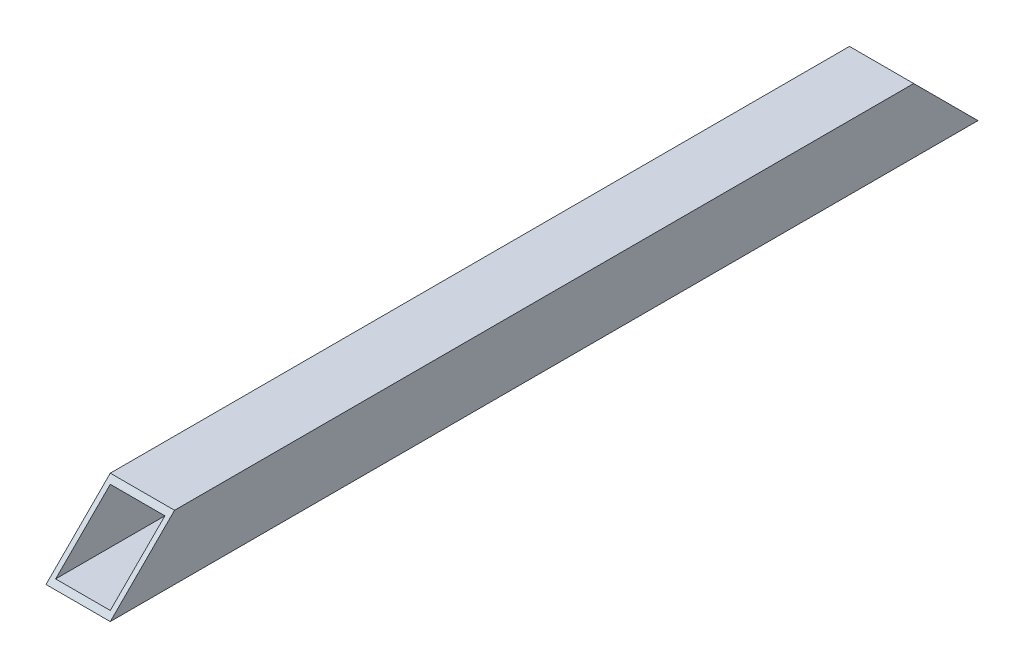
ISO-10303-21;
HEADER;
FILE_DESCRIPTION(('STEP AP214'),'2;1');
FILE_NAME('part.step','',(''),(''),'','','');
FILE_SCHEMA(('AUTOMOTIVE_DESIGN { 1 0 10303 214 1 1 1 1 }'));
ENDSEC;
DATA;
#1=APPLICATION_CONTEXT('core data for automotive mechanical design processes');
#2=APPLICATION_PROTOCOL_DEFINITION('international standard','automotive_design',2000,#1);
#3=PRODUCT_CONTEXT('',#1,'mechanical');
#4=PRODUCT('Part','Part','',(#3));
#5=PRODUCT_RELATED_PRODUCT_CATEGORY('part','',(#4));
#6=PRODUCT_DEFINITION_FORMATION('','',#4);
#7=PRODUCT_DEFINITION_CONTEXT('part definition',#1,'design');
#8=PRODUCT_DEFINITION('design','',#6,#7);
#9=PRODUCT_DEFINITION_SHAPE('','',#8);
#10=(LENGTH_UNIT() NAMED_UNIT(*) SI_UNIT(.MILLI.,.METRE.));
#11=(NAMED_UNIT(*) PLANE_ANGLE_UNIT() SI_UNIT($,.RADIAN.));
#12=(NAMED_UNIT(*) SI_UNIT($,.STERADIAN.) SOLID_ANGLE_UNIT());
#13=UNCERTAINTY_MEASURE_WITH_UNIT(LENGTH_MEASURE(1.E-05),#10,'distance_accuracy_value','');
#14=(GEOMETRIC_REPRESENTATION_CONTEXT(3) GLOBAL_UNCERTAINTY_ASSIGNED_CONTEXT((#13)) GLOBAL_UNIT_ASSIGNED_CONTEXT((#10,
#11,#12)) REPRESENTATION_CONTEXT('',''));
#15=CARTESIAN_POINT('',(0.,0.,0.));
#16=DIRECTION('',(0.,0.,1.));
#17=DIRECTION('',(1.,0.,0.));
#18=AXIS2_PLACEMENT_3D('',#15,#16,#17);
#19=CARTESIAN_POINT('',(0.,0.,540.));
#20=DIRECTION('',(1.,0.,0.));
#21=DIRECTION('',(0.,1.,0.));
#22=AXIS2_PLACEMENT_3D('',#19,#20,#21);
#23=PLANE('',#22);
#24=DIRECTION('',(0.,0.,-1.));
#25=VECTOR('',#24,1.);
#26=CARTESIAN_POINT('',(0.,40.,540.));
#27=LINE('',#26,#25);
#28=CARTESIAN_POINT('',(0.,40.,500.));
#29=VERTEX_POINT('',#28);
#30=CARTESIAN_POINT('',(0.,40.,40.0000000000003));
#31=VERTEX_POINT('',#30);
#32=EDGE_CURVE('E131',#29,#31,#27,.T.);
#33=ORIENTED_EDGE('',*,*,#32,.T.);
#34=DIRECTION('',(0.,-0.707106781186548,-0.707106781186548));
#35=VECTOR('',#34,1.);
#36=CARTESIAN_POINT('',(0.,40.,40.0000000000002));
#37=LINE('',#36,#35);
#38=CARTESIAN_POINT('',(0.,0.,0.));
#39=VERTEX_POINT('',#38);
#40=EDGE_CURVE('E42',#31,#39,#37,.T.);
#41=ORIENTED_EDGE('',*,*,#40,.T.);
#42=DIRECTION('',(0.,0.,-1.));
#43=VECTOR('',#42,1.);
#44=CARTESIAN_POINT('',(0.,0.,540.));
#45=LINE('',#44,#43);
#46=CARTESIAN_POINT('',(0.,0.,540.));
#47=VERTEX_POINT('',#46);
#48=EDGE_CURVE('E124',#47,#39,#45,.T.);
#49=ORIENTED_EDGE('',*,*,#48,.F.);
#50=DIRECTION('',(0.,-0.707106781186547,0.707106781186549));
#51=VECTOR('',#50,1.);
#52=CARTESIAN_POINT('',(0.,0.,540.));
#53=LINE('',#52,#51);
#54=EDGE_CURVE('E121',#47,#29,#53,.F.);
#55=ORIENTED_EDGE('',*,*,#54,.T.);
#56=EDGE_LOOP('',(#33,#41,#49,#55));
#57=FACE_BOUND('',#56,.T.);
#58=ADVANCED_FACE('F32',(#57),#23,.F.);
#59=CARTESIAN_POINT('',(0.,0.,540.));
#60=DIRECTION('',(0.,1.,0.));
#61=DIRECTION('',(0.,0.,1.));
#62=AXIS2_PLACEMENT_3D('',#59,#60,#61);
#63=PLANE('',#62);
#64=DIRECTION('',(1.,0.,0.));
#65=VECTOR('',#64,1.);
#66=CARTESIAN_POINT('',(0.,0.,0.));
#67=LINE('',#66,#65);
#68=CARTESIAN_POINT('',(40.,0.,0.));
#69=VERTEX_POINT('',#68);
#70=EDGE_CURVE('E88',#39,#69,#67,.T.);
#71=ORIENTED_EDGE('',*,*,#70,.T.);
#72=DIRECTION('',(0.,0.,-1.));
#73=VECTOR('',#72,1.);
#74=CARTESIAN_POINT('',(40.,0.,540.));
#75=LINE('',#74,#73);
#76=CARTESIAN_POINT('',(40.,0.,540.));
#77=VERTEX_POINT('',#76);
#78=EDGE_CURVE('E127',#77,#69,#75,.T.);
#79=ORIENTED_EDGE('',*,*,#78,.F.);
#80=DIRECTION('',(1.,0.,0.));
#81=VECTOR('',#80,1.);
#82=CARTESIAN_POINT('',(0.,0.,540.));
#83=LINE('',#82,#81);
#84=EDGE_CURVE('E134',#47,#77,#83,.T.);
#85=ORIENTED_EDGE('',*,*,#84,.F.);
#86=ORIENTED_EDGE('',*,*,#48,.T.);
#87=EDGE_LOOP('',(#71,#79,#85,#86));
#88=FACE_BOUND('',#87,.T.);
#89=ADVANCED_FACE('F173',(#88),#63,.F.);
#90=CARTESIAN_POINT('',(40.,0.,540.));
#91=DIRECTION('',(-1.,0.,0.));
#92=DIRECTION('',(0.,-1.,0.));
#93=AXIS2_PLACEMENT_3D('',#90,#91,#92);
#94=PLANE('',#93);
#95=ORIENTED_EDGE('',*,*,#78,.T.);
#96=DIRECTION('',(0.,0.707106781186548,0.707106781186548));
#97=VECTOR('',#96,1.);
#98=CARTESIAN_POINT('',(40.,40.,40.0000000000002));
#99=LINE('',#98,#97);
#100=CARTESIAN_POINT('',(40.,40.,40.0000000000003));
#101=VERTEX_POINT('',#100);
#102=EDGE_CURVE('E11',#69,#101,#99,.T.);
#103=ORIENTED_EDGE('',*,*,#102,.T.);
#104=DIRECTION('',(0.,0.,-1.));
#105=VECTOR('',#104,1.);
#106=CARTESIAN_POINT('',(40.,40.,540.));
#107=LINE('',#106,#105);
#108=CARTESIAN_POINT('',(40.,40.,500.));
#109=VERTEX_POINT('',#108);
#110=EDGE_CURVE('E129',#109,#101,#107,.T.);
#111=ORIENTED_EDGE('',*,*,#110,.F.);
#112=DIRECTION('',(0.,0.707106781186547,-0.707106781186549));
#113=VECTOR('',#112,1.);
#114=CARTESIAN_POINT('',(40.,0.,540.));
#115=LINE('',#114,#113);
#116=EDGE_CURVE('E107',#109,#77,#115,.F.);
#117=ORIENTED_EDGE('',*,*,#116,.T.);
#118=EDGE_LOOP('',(#95,#103,#111,#117));
#119=FACE_BOUND('',#118,.T.);
#120=ADVANCED_FACE('F179',(#119),#94,.F.);
#121=CARTESIAN_POINT('',(0.,40.,540.));
#122=DIRECTION('',(0.,-1.,0.));
#123=DIRECTION('',(0.,0.,-1.));
#124=AXIS2_PLACEMENT_3D('',#121,#122,#123);
#125=PLANE('',#124);
#126=ORIENTED_EDGE('',*,*,#110,.T.);
#127=DIRECTION('',(-1.,0.,0.));
#128=VECTOR('',#127,1.);
#129=CARTESIAN_POINT('',(0.,40.,40.0000000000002));
#130=LINE('',#129,#128);
#131=EDGE_CURVE('E104',#101,#31,#130,.T.);
#132=ORIENTED_EDGE('',*,*,#131,.T.);
#133=ORIENTED_EDGE('',*,*,#32,.F.);
#134=DIRECTION('',(1.,0.,0.));
#135=VECTOR('',#134,1.);
#136=CARTESIAN_POINT('',(0.,40.,500.));
#137=LINE('',#136,#135);
#138=EDGE_CURVE('E118',#29,#109,#137,.T.);
#139=ORIENTED_EDGE('',*,*,#138,.T.);
#140=EDGE_LOOP('',(#126,#132,#133,#139));
#141=FACE_BOUND('',#140,.T.);
#142=ADVANCED_FACE('F176',(#141),#125,.F.);
#143=CARTESIAN_POINT('',(2.99999999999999,37.,540.));
#144=DIRECTION('',(1.,0.,0.));
#145=DIRECTION('',(0.,1.,0.));
#146=AXIS2_PLACEMENT_3D('',#143,#144,#145);
#147=PLANE('',#146);
#148=DIRECTION('',(0.,-0.707106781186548,-0.707106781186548));
#149=VECTOR('',#148,1.);
#150=CARTESIAN_POINT('',(2.99999999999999,40.,40.0000000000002));
#151=LINE('',#150,#149);
#152=CARTESIAN_POINT('',(2.99999999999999,37.,37.0000000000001));
#153=VERTEX_POINT('',#152);
#154=CARTESIAN_POINT('',(3.,3.,3.00000000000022));
#155=VERTEX_POINT('',#154);
#156=EDGE_CURVE('E36',#153,#155,#151,.T.);
#157=ORIENTED_EDGE('',*,*,#156,.F.);
#158=DIRECTION('',(0.,0.,-1.));
#159=VECTOR('',#158,1.);
#160=CARTESIAN_POINT('',(2.99999999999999,37.,540.));
#161=LINE('',#160,#159);
#162=CARTESIAN_POINT('',(2.99999999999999,37.,503.));
#163=VERTEX_POINT('',#162);
#164=EDGE_CURVE('E111',#163,#153,#161,.T.);
#165=ORIENTED_EDGE('',*,*,#164,.F.);
#166=DIRECTION('',(0.,0.707106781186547,-0.707106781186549));
#167=VECTOR('',#166,1.);
#168=CARTESIAN_POINT('',(2.99999999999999,18.4999999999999,521.5));
#169=LINE('',#168,#167);
#170=CARTESIAN_POINT('',(3.,3.,537.));
#171=VERTEX_POINT('',#170);
#172=EDGE_CURVE('E87',#163,#171,#169,.F.);
#173=ORIENTED_EDGE('',*,*,#172,.T.);
#174=DIRECTION('',(0.,0.,-1.));
#175=VECTOR('',#174,1.);
#176=CARTESIAN_POINT('',(3.,3.,540.));
#177=LINE('',#176,#175);
#178=EDGE_CURVE('E71',#171,#155,#177,.T.);
#179=ORIENTED_EDGE('',*,*,#178,.T.);
#180=EDGE_LOOP('',(#157,#165,#173,#179));
#181=FACE_BOUND('',#180,.T.);
#182=ADVANCED_FACE('F83',(#181),#147,.T.);
#183=CARTESIAN_POINT('',(3.,3.,540.));
#184=DIRECTION('',(0.,1.,0.));
#185=DIRECTION('',(0.,0.,1.));
#186=AXIS2_PLACEMENT_3D('',#183,#184,#185);
#187=PLANE('',#186);
#188=DIRECTION('',(1.,0.,0.));
#189=VECTOR('',#188,1.);
#190=CARTESIAN_POINT('',(0.,3.,3.0000000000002));
#191=LINE('',#190,#189);
#192=CARTESIAN_POINT('',(37.,3.,3.00000000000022));
#193=VERTEX_POINT('',#192);
#194=EDGE_CURVE('E67',#155,#193,#191,.T.);
#195=ORIENTED_EDGE('',*,*,#194,.F.);
#196=ORIENTED_EDGE('',*,*,#178,.F.);
#197=DIRECTION('',(-1.,0.,0.));
#198=VECTOR('',#197,1.);
#199=CARTESIAN_POINT('',(3.,3.,537.));
#200=LINE('',#199,#198);
#201=CARTESIAN_POINT('',(37.,3.,537.));
#202=VERTEX_POINT('',#201);
#203=EDGE_CURVE('E98',#171,#202,#200,.F.);
#204=ORIENTED_EDGE('',*,*,#203,.T.);
#205=DIRECTION('',(0.,0.,-1.));
#206=VECTOR('',#205,1.);
#207=CARTESIAN_POINT('',(37.,3.,540.));
#208=LINE('',#207,#206);
#209=EDGE_CURVE('E74',#202,#193,#208,.T.);
#210=ORIENTED_EDGE('',*,*,#209,.T.);
#211=EDGE_LOOP('',(#195,#196,#204,#210));
#212=FACE_BOUND('',#211,.T.);
#213=ADVANCED_FACE('F69',(#212),#187,.T.);
#214=CARTESIAN_POINT('',(37.,37.,540.));
#215=DIRECTION('',(-1.,0.,0.));
#216=DIRECTION('',(0.,0.,1.));
#217=AXIS2_PLACEMENT_3D('',#214,#215,#216);
#218=PLANE('',#217);
#219=DIRECTION('',(0.,0.707106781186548,0.707106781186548));
#220=VECTOR('',#219,1.);
#221=CARTESIAN_POINT('',(37.,40.,40.0000000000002));
#222=LINE('',#221,#220);
#223=CARTESIAN_POINT('',(37.,37.,37.0000000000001));
#224=VERTEX_POINT('',#223);
#225=EDGE_CURVE('E79',#193,#224,#222,.T.);
#226=ORIENTED_EDGE('',*,*,#225,.F.);
#227=ORIENTED_EDGE('',*,*,#209,.F.);
#228=DIRECTION('',(0.,-0.707106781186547,0.707106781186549));
#229=VECTOR('',#228,1.);
#230=CARTESIAN_POINT('',(37.,18.4999999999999,521.5));
#231=LINE('',#230,#229);
#232=CARTESIAN_POINT('',(37.,37.,503.));
#233=VERTEX_POINT('',#232);
#234=EDGE_CURVE('E112',#202,#233,#231,.F.);
#235=ORIENTED_EDGE('',*,*,#234,.T.);
#236=DIRECTION('',(0.,0.,-1.));
#237=VECTOR('',#236,1.);
#238=CARTESIAN_POINT('',(37.,37.,540.));
#239=LINE('',#238,#237);
#240=EDGE_CURVE('E140',#233,#224,#239,.T.);
#241=ORIENTED_EDGE('',*,*,#240,.T.);
#242=EDGE_LOOP('',(#226,#227,#235,#241));
#243=FACE_BOUND('',#242,.T.);
#244=ADVANCED_FACE('F153',(#243),#218,.T.);
#245=CARTESIAN_POINT('',(2.99999999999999,37.,540.));
#246=DIRECTION('',(0.,-1.,0.));
#247=DIRECTION('',(0.,0.,-1.));
#248=AXIS2_PLACEMENT_3D('',#245,#246,#247);
#249=PLANE('',#248);
#250=DIRECTION('',(-1.,0.,0.));
#251=VECTOR('',#250,1.);
#252=CARTESIAN_POINT('',(0.,37.,37.0000000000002));
#253=LINE('',#252,#251);
#254=EDGE_CURVE('E92',#224,#153,#253,.T.);
#255=ORIENTED_EDGE('',*,*,#254,.F.);
#256=ORIENTED_EDGE('',*,*,#240,.F.);
#257=DIRECTION('',(1.,0.,0.));
#258=VECTOR('',#257,1.);
#259=CARTESIAN_POINT('',(2.99999999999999,37.,503.));
#260=LINE('',#259,#258);
#261=EDGE_CURVE('E108',#233,#163,#260,.F.);
#262=ORIENTED_EDGE('',*,*,#261,.T.);
#263=ORIENTED_EDGE('',*,*,#164,.T.);
#264=EDGE_LOOP('',(#255,#256,#262,#263));
#265=FACE_BOUND('',#264,.T.);
#266=ADVANCED_FACE('F142',(#265),#249,.T.);
#267=CARTESIAN_POINT('',(0.,0.,540.));
#268=DIRECTION('',(0.,-0.707106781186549,-0.707106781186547));
#269=DIRECTION('',(0.,0.707106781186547,-0.707106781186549));
#270=AXIS2_PLACEMENT_3D('',#267,#268,#269);
#271=PLANE('',#270);
#272=ORIENTED_EDGE('',*,*,#116,.F.);
#273=ORIENTED_EDGE('',*,*,#138,.F.);
#274=ORIENTED_EDGE('',*,*,#54,.F.);
#275=ORIENTED_EDGE('',*,*,#84,.T.);
#276=EDGE_LOOP('',(#272,#273,#274,#275));
#277=FACE_BOUND('',#276,.T.);
#278=ORIENTED_EDGE('',*,*,#172,.F.);
#279=ORIENTED_EDGE('',*,*,#261,.F.);
#280=ORIENTED_EDGE('',*,*,#234,.F.);
#281=ORIENTED_EDGE('',*,*,#203,.F.);
#282=EDGE_LOOP('',(#278,#279,#280,#281));
#283=FACE_BOUND('',#282,.T.);
#284=ADVANCED_FACE('F148',(#277,#283),#271,.F.);
#285=CARTESIAN_POINT('',(0.,40.,40.0000000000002));
#286=DIRECTION('',(0.,0.707106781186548,-0.707106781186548));
#287=DIRECTION('',(0.,0.707106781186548,0.707106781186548));
#288=AXIS2_PLACEMENT_3D('',#285,#286,#287);
#289=PLANE('',#288);
#290=ORIENTED_EDGE('',*,*,#102,.F.);
#291=ORIENTED_EDGE('',*,*,#70,.F.);
#292=ORIENTED_EDGE('',*,*,#40,.F.);
#293=ORIENTED_EDGE('',*,*,#131,.F.);
#294=EDGE_LOOP('',(#290,#291,#292,#293));
#295=FACE_BOUND('',#294,.T.);
#296=ORIENTED_EDGE('',*,*,#254,.T.);
#297=ORIENTED_EDGE('',*,*,#156,.T.);
#298=ORIENTED_EDGE('',*,*,#194,.T.);
#299=ORIENTED_EDGE('',*,*,#225,.T.);
#300=EDGE_LOOP('',(#296,#297,#298,#299));
#301=FACE_BOUND('',#300,.T.);
#302=ADVANCED_FACE('F34',(#295,#301),#289,.T.);
#303=CLOSED_SHELL('',(#58,#89,#120,#142,#182,#213,#244,#266,#284,#302));
#304=MANIFOLD_SOLID_BREP('B2',#303);
#305=ADVANCED_BREP_SHAPE_REPRESENTATION('',(#18,#304),#14);
#306=SHAPE_DEFINITION_REPRESENTATION(#9,#305);
ENDSEC;
END-ISO-10303-21;
